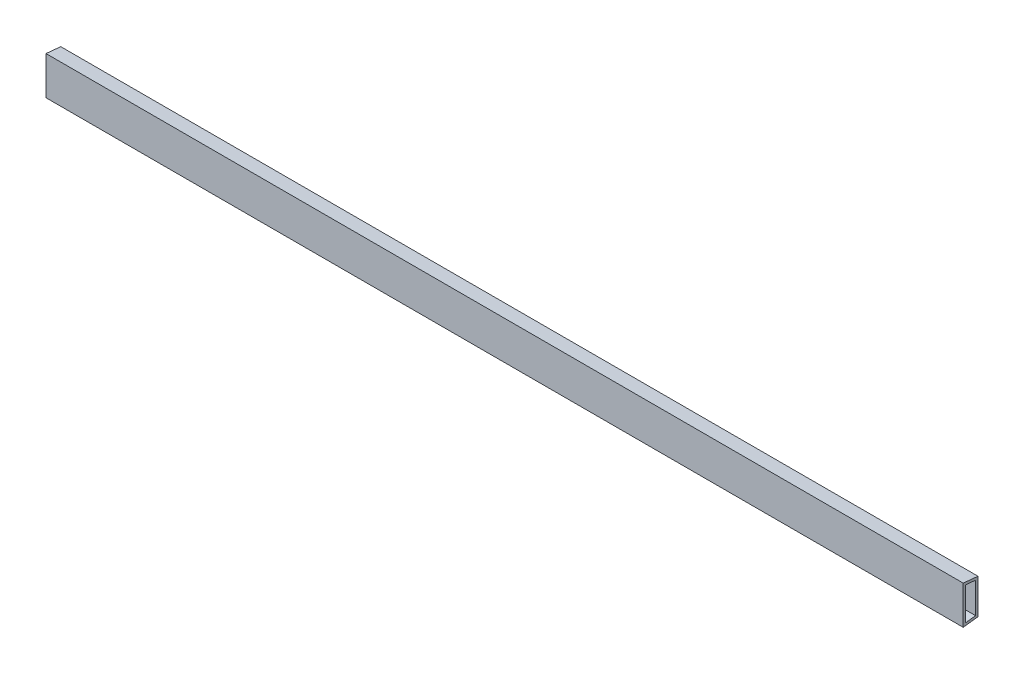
from build123d import *

# Parameters (mm, degrees)
BOSS_EXTRUDE1_DEPTH = 147.6375


with BuildPart() as part:
    # Sketch1 → Boss-Extrude1 (new, symmetric)
    with BuildSketch(Plane(origin=(0, 0, 0), x_dir=(0, 0, -1), z_dir=(1, 0, 0))):
        with BuildLine():
            Line((63.5, 18.80831469), (63.5, 6.474517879))
            add(Edge.make_bspline(
                [(63.5, 6.474517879), (64.309431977, 6.576595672), (65.896276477, 6.770977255), (67.48447316, 6.954052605), (68.2625, 7.040859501)],
                knots=[0.725427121, 0.725427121, 0.725427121, 0.725427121, 0.733426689, 0.741102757, 0.741102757, 0.741102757, 0.741102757], degree=3))
            Line((68.2625, 7.040859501), (68.2625, 18.347143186))
            add(Edge.make_bspline(
                [(68.2625, 18.347143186), (67.5841444, 18.416445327), (65.997128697, 18.575171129), (64.409289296, 18.72559125), (63.5, 18.80831469)],
                knots=[1.263854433, 1.263854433, 1.263854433, 1.263854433, 1.270540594, 1.279493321, 1.279493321, 1.279493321, 1.279493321], degree=3))
        make_face()
        with BuildLine():
            Line((64.29375, 17.938061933), (64.29375, 7.373467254))
            add(Edge.make_bspline(
                [(64.29375, 7.373467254), (65.351478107, 7.504041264), (66.409826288, 7.629695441), (67.46875, 7.75018981)],
                knots=[0.728361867, 0.728361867, 0.728361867, 0.728361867, 0.738787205, 0.738787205, 0.738787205, 0.738787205], degree=3))
            Line((67.46875, 7.75018981), (67.46875, 17.629812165))
            add(Edge.make_bspline(
                [(67.46875, 17.629812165), (66.410784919, 17.736286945), (65.352462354, 17.839293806), (64.29375, 17.938061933)],
                knots=[1.266200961, 1.266200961, 1.266200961, 1.266200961, 1.276645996, 1.276645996, 1.276645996, 1.276645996], degree=3))
        make_face(mode=Mode.SUBTRACT)
    extrude(amount=BOSS_EXTRUDE1_DEPTH, both=True)


solid = part.part
